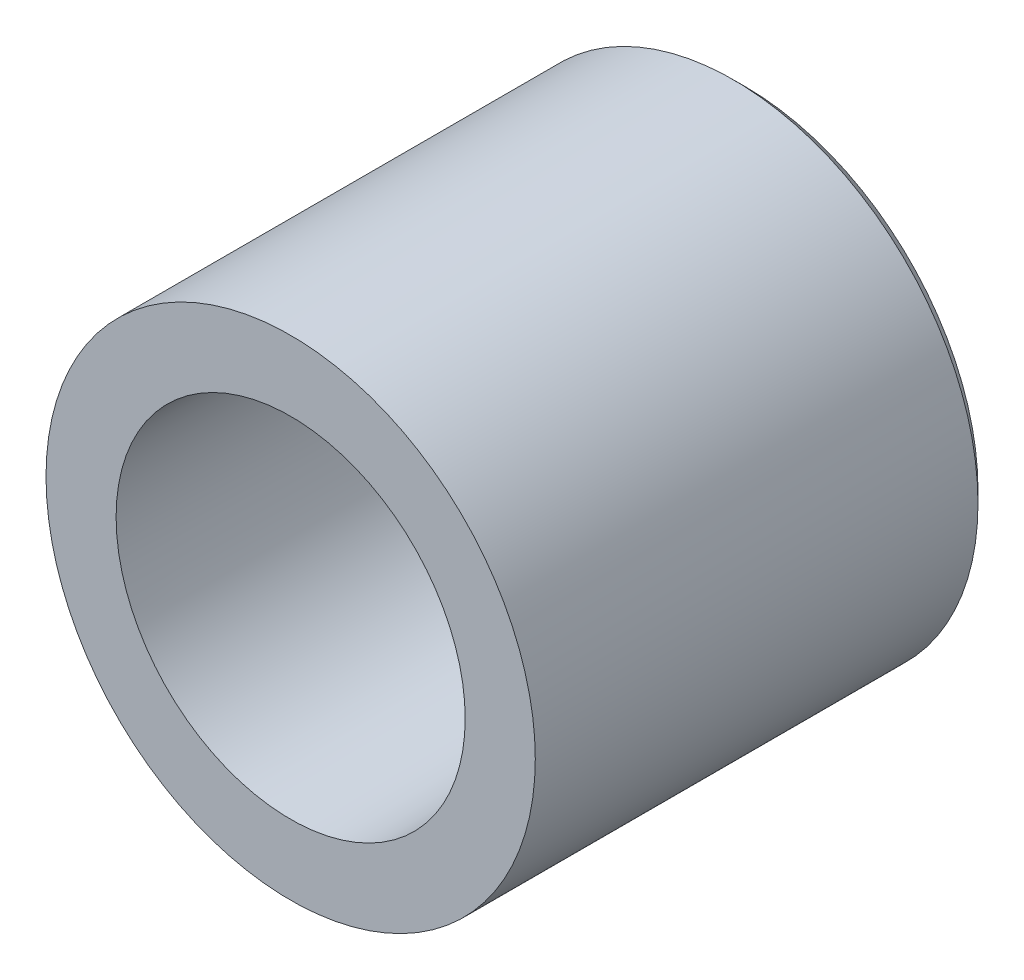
ISO-10303-21;
HEADER;
FILE_DESCRIPTION(('STEP AP214'),'2;1');
FILE_NAME('part.step','',(''),(''),'','','');
FILE_SCHEMA(('AUTOMOTIVE_DESIGN { 1 0 10303 214 1 1 1 1 }'));
ENDSEC;
DATA;
#1=APPLICATION_CONTEXT('core data for automotive mechanical design processes');
#2=APPLICATION_PROTOCOL_DEFINITION('international standard','automotive_design',2000,#1);
#3=PRODUCT_CONTEXT('',#1,'mechanical');
#4=PRODUCT('Part','Part','',(#3));
#5=PRODUCT_RELATED_PRODUCT_CATEGORY('part','',(#4));
#6=PRODUCT_DEFINITION_FORMATION('','',#4);
#7=PRODUCT_DEFINITION_CONTEXT('part definition',#1,'design');
#8=PRODUCT_DEFINITION('design','',#6,#7);
#9=PRODUCT_DEFINITION_SHAPE('','',#8);
#10=(LENGTH_UNIT() NAMED_UNIT(*) SI_UNIT(.MILLI.,.METRE.));
#11=(NAMED_UNIT(*) PLANE_ANGLE_UNIT() SI_UNIT($,.RADIAN.));
#12=(NAMED_UNIT(*) SI_UNIT($,.STERADIAN.) SOLID_ANGLE_UNIT());
#13=UNCERTAINTY_MEASURE_WITH_UNIT(LENGTH_MEASURE(1.E-05),#10,'distance_accuracy_value','');
#14=(GEOMETRIC_REPRESENTATION_CONTEXT(3) GLOBAL_UNCERTAINTY_ASSIGNED_CONTEXT((#13)) GLOBAL_UNIT_ASSIGNED_CONTEXT((#10,
#11,#12)) REPRESENTATION_CONTEXT('',''));
#15=CARTESIAN_POINT('',(0.,0.,0.));
#16=DIRECTION('',(0.,0.,1.));
#17=DIRECTION('',(1.,0.,0.));
#18=AXIS2_PLACEMENT_3D('',#15,#16,#17);
#19=CARTESIAN_POINT('',(-1.39382166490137E-13,0.,-19.9603195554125));
#20=DIRECTION('',(0.,0.,1.));
#21=DIRECTION('',(1.,0.,0.));
#22=AXIS2_PLACEMENT_3D('',#19,#20,#21);
#23=CONICAL_SURFACE('',#22,20.6207588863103,0.785398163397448);
#24=CARTESIAN_POINT('',(-1.88539992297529E-13,0.,-27.));
#25=DIRECTION('',(0.,0.,1.));
#26=DIRECTION('',(-1.,0.,0.));
#27=AXIS2_PLACEMENT_3D('',#24,#25,#26);
#28=CIRCLE('',#27,13.5810784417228);
#29=CARTESIAN_POINT('',(13.5810784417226,0.,-27.));
#30=VERTEX_POINT('',#29);
#31=CARTESIAN_POINT('',(-13.581078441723,0.,-27.));
#32=VERTEX_POINT('',#31);
#33=EDGE_CURVE('E143',#30,#32,#28,.T.);
#34=ORIENTED_EDGE('',*,*,#33,.F.);
#35=CARTESIAN_POINT('',(13.5810785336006,0.,-26.9999999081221));
#36=CARTESIAN_POINT('',(14.5810800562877,0.,-25.999998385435));
#37=B_SPLINE_CURVE_WITH_KNOTS('',1,(#35,#36),.UNSPECIFIED.,.F.,.F.,(2,2),(0.658611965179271,
0.707106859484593),.UNSPECIFIED.);
#38=CARTESIAN_POINT('',(14.5810784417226,0.,-26.));
#39=VERTEX_POINT('',#38);
#40=EDGE_CURVE('E44',#30,#39,#37,.T.);
#41=ORIENTED_EDGE('',*,*,#40,.T.);
#42=CARTESIAN_POINT('',(-1.81557029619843E-13,0.,-26.));
#43=DIRECTION('',(0.,0.,-1.));
#44=DIRECTION('',(-1.,0.,0.));
#45=AXIS2_PLACEMENT_3D('',#42,#43,#44);
#46=CIRCLE('',#45,14.5810784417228);
#47=CARTESIAN_POINT('',(-14.581078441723,0.,-26.));
#48=VERTEX_POINT('',#47);
#49=EDGE_CURVE('E11',#48,#39,#46,.T.);
#50=ORIENTED_EDGE('',*,*,#49,.F.);
#51=CARTESIAN_POINT('',(-1.81557029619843E-13,0.,-26.));
#52=DIRECTION('',(0.,0.,-1.));
#53=DIRECTION('',(-1.,0.,0.));
#54=AXIS2_PLACEMENT_3D('',#51,#52,#53);
#55=CIRCLE('',#54,14.5810784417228);
#56=EDGE_CURVE('E51',#39,#48,#55,.T.);
#57=ORIENTED_EDGE('',*,*,#56,.F.);
#58=ORIENTED_EDGE('',*,*,#40,.F.);
#59=CARTESIAN_POINT('',(-1.88539992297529E-13,0.,-27.));
#60=DIRECTION('',(0.,0.,1.));
#61=DIRECTION('',(-1.,0.,0.));
#62=AXIS2_PLACEMENT_3D('',#59,#60,#61);
#63=CIRCLE('',#62,13.5810784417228);
#64=EDGE_CURVE('E59',#32,#30,#63,.T.);
#65=ORIENTED_EDGE('',*,*,#64,.F.);
#66=EDGE_LOOP('',(#34,#41,#50,#57,#58,#65));
#67=FACE_BOUND('',#66,.T.);
#68=ADVANCED_FACE('F36',(#67),#23,.F.);
#69=CARTESIAN_POINT('',(-1.78065548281E-13,0.,-25.5));
#70=DIRECTION('',(0.,0.,-1.));
#71=DIRECTION('',(-1.,0.,0.));
#72=AXIS2_PLACEMENT_3D('',#69,#70,#71);
#73=CYLINDRICAL_SURFACE('',#72,14.5810784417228);
#74=CARTESIAN_POINT('',(-1.6759110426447E-13,0.,-24.));
#75=DIRECTION('',(0.,0.,-1.));
#76=DIRECTION('',(-1.,0.,0.));
#77=AXIS2_PLACEMENT_3D('',#74,#75,#76);
#78=CIRCLE('',#77,14.5810784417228);
#79=CARTESIAN_POINT('',(-14.5810784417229,0.,-24.));
#80=VERTEX_POINT('',#79);
#81=EDGE_CURVE('E152',#80,#80,#78,.T.);
#82=ORIENTED_EDGE('',*,*,#81,.F.);
#83=CARTESIAN_POINT('',(-14.5810784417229,0.,-23.9999969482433));
#84=CARTESIAN_POINT('',(-14.581078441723,0.,-26.0000020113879));
#85=B_SPLINE_CURVE_WITH_KNOTS('',1,(#83,#84),.UNSPECIFIED.,.F.,.F.,(2,2),(0.0833320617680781,
0.91666750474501),.UNSPECIFIED.);
#86=EDGE_CURVE('E147',#80,#48,#85,.T.);
#87=ORIENTED_EDGE('',*,*,#86,.T.);
#88=ORIENTED_EDGE('',*,*,#49,.T.);
#89=ORIENTED_EDGE('',*,*,#56,.T.);
#90=ORIENTED_EDGE('',*,*,#86,.F.);
#91=EDGE_LOOP('',(#82,#87,#88,#89,#90));
#92=FACE_BOUND('',#91,.T.);
#93=ADVANCED_FACE('F191',(#92),#73,.F.);
#94=CARTESIAN_POINT('',(31.2364804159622,-28.2277414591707,-27.));
#95=DIRECTION('',(0.,0.,-1.));
#96=DIRECTION('',(-1.,0.,0.));
#97=AXIS2_PLACEMENT_3D('',#94,#95,#96);
#98=PLANE('',#97);
#99=CARTESIAN_POINT('',(-2.79318507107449E-13,0.,-26.9999999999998));
#100=DIRECTION('',(0.,0.,-1.));
#101=DIRECTION('',(-1.,0.,0.));
#102=AXIS2_PLACEMENT_3D('',#99,#100,#101);
#103=CIRCLE('',#102,5.09999999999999);
#104=CARTESIAN_POINT('',(-5.10000000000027,0.,-26.9999999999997));
#105=VERTEX_POINT('',#104);
#106=EDGE_CURVE('E103',#105,#105,#103,.T.);
#107=ORIENTED_EDGE('',*,*,#106,.T.);
#108=EDGE_LOOP('',(#107));
#109=FACE_BOUND('',#108,.T.);
#110=ORIENTED_EDGE('',*,*,#64,.T.);
#111=ORIENTED_EDGE('',*,*,#33,.T.);
#112=EDGE_LOOP('',(#110,#111));
#113=FACE_BOUND('',#112,.T.);
#114=ADVANCED_FACE('F193',(#109,#113),#98,.F.);
#115=CARTESIAN_POINT('',(0.,0.,-1.));
#116=DIRECTION('',(0.,0.,1.));
#117=DIRECTION('',(-1.,0.,0.));
#118=AXIS2_PLACEMENT_3D('',#115,#116,#117);
#119=CONICAL_SURFACE('',#118,14.9825449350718,0.0174532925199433);
#120=ORIENTED_EDGE('',*,*,#81,.T.);
#121=CARTESIAN_POINT('',(-14.5810784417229,0.,-24.));
#122=CARTESIAN_POINT('',(-14.9825449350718,0.,-0.999999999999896));
#123=B_SPLINE_CURVE_WITH_KNOTS('',1,(#121,#122),.UNSPECIFIED.,.F.,.F.,(2,2),(0.,1.),.UNSPECIFIED.);
#124=CARTESIAN_POINT('',(-14.9825449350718,0.,-0.999999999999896));
#125=VERTEX_POINT('',#124);
#126=EDGE_CURVE('E108',#80,#125,#123,.T.);
#127=ORIENTED_EDGE('',*,*,#126,.T.);
#128=CARTESIAN_POINT('',(0.,0.,-1.));
#129=DIRECTION('',(0.,0.,-1.));
#130=DIRECTION('',(1.,0.,0.));
#131=AXIS2_PLACEMENT_3D('',#128,#129,#130);
#132=CIRCLE('',#131,14.9825449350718);
#133=CARTESIAN_POINT('',(14.9825449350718,0.,-1.0000000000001));
#134=VERTEX_POINT('',#133);
#135=EDGE_CURVE('E133',#134,#125,#132,.T.);
#136=ORIENTED_EDGE('',*,*,#135,.F.);
#137=CARTESIAN_POINT('',(0.,0.,-1.));
#138=DIRECTION('',(0.,0.,-1.));
#139=DIRECTION('',(1.,0.,0.));
#140=AXIS2_PLACEMENT_3D('',#137,#138,#139);
#141=CIRCLE('',#140,14.9825449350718);
#142=EDGE_CURVE('E126',#125,#134,#141,.T.);
#143=ORIENTED_EDGE('',*,*,#142,.F.);
#144=ORIENTED_EDGE('',*,*,#126,.F.);
#145=EDGE_LOOP('',(#120,#127,#136,#143,#144));
#146=FACE_BOUND('',#145,.T.);
#147=ADVANCED_FACE('F189',(#146),#119,.F.);
#148=CARTESIAN_POINT('',(-2.11594349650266E-13,0.,-30.301515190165));
#149=DIRECTION('',(0.,0.,1.));
#150=DIRECTION('',(1.,0.,0.));
#151=AXIS2_PLACEMENT_3D('',#148,#149,#150);
#152=CONICAL_SURFACE('',#151,29.698484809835,0.785398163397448);
#153=CARTESIAN_POINT('',(-2.7931850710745E-13,0.,-40.));
#154=DIRECTION('',(0.,0.,1.));
#155=DIRECTION('',(-1.,0.,0.));
#156=AXIS2_PLACEMENT_3D('',#153,#154,#155);
#157=CIRCLE('',#156,20.);
#158=CARTESIAN_POINT('',(-20.0000000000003,0.,-40.));
#159=VERTEX_POINT('',#158);
#160=CARTESIAN_POINT('',(19.9999999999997,0.,-40.));
#161=VERTEX_POINT('',#160);
#162=EDGE_CURVE('E90',#159,#161,#157,.T.);
#163=ORIENTED_EDGE('',*,*,#162,.T.);
#164=CARTESIAN_POINT('',(20.0000025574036,0.,-39.9999974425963));
#165=CARTESIAN_POINT('',(21.0000013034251,0.,-38.9999986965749));
#166=B_SPLINE_CURVE_WITH_KNOTS('',1,(#164,#165),.UNSPECIFIED.,.F.,.F.,(2,2),(0.673435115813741,
0.707106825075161),.UNSPECIFIED.);
#167=CARTESIAN_POINT('',(20.9999999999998,0.,-39.));
#168=VERTEX_POINT('',#167);
#169=EDGE_CURVE('E95',#161,#168,#166,.T.);
#170=ORIENTED_EDGE('',*,*,#169,.T.);
#171=CARTESIAN_POINT('',(-2.72335544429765E-13,0.,-39.));
#172=DIRECTION('',(0.,0.,-1.));
#173=DIRECTION('',(-1.,0.,0.));
#174=AXIS2_PLACEMENT_3D('',#171,#172,#173);
#175=CIRCLE('',#174,21.);
#176=CARTESIAN_POINT('',(-21.0000000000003,0.,-39.));
#177=VERTEX_POINT('',#176);
#178=EDGE_CURVE('E102',#168,#177,#175,.T.);
#179=ORIENTED_EDGE('',*,*,#178,.T.);
#180=CARTESIAN_POINT('',(-2.72335544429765E-13,0.,-39.));
#181=DIRECTION('',(0.,0.,-1.));
#182=DIRECTION('',(-1.,0.,0.));
#183=AXIS2_PLACEMENT_3D('',#180,#181,#182);
#184=CIRCLE('',#183,21.);
#185=EDGE_CURVE('E105',#177,#168,#184,.T.);
#186=ORIENTED_EDGE('',*,*,#185,.T.);
#187=ORIENTED_EDGE('',*,*,#169,.F.);
#188=CARTESIAN_POINT('',(-2.7931850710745E-13,0.,-40.));
#189=DIRECTION('',(0.,0.,1.));
#190=DIRECTION('',(-1.,0.,0.));
#191=AXIS2_PLACEMENT_3D('',#188,#189,#190);
#192=CIRCLE('',#191,20.);
#193=EDGE_CURVE('E97',#161,#159,#192,.T.);
#194=ORIENTED_EDGE('',*,*,#193,.T.);
#195=EDGE_LOOP('',(#163,#170,#179,#186,#187,#194));
#196=FACE_BOUND('',#195,.T.);
#197=ADVANCED_FACE('F92',(#196),#152,.T.);
#198=CARTESIAN_POINT('',(-1.43150734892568E-13,0.,-20.5));
#199=DIRECTION('',(0.,0.,-1.));
#200=DIRECTION('',(-1.,0.,0.));
#201=AXIS2_PLACEMENT_3D('',#198,#199,#200);
#202=CYLINDRICAL_SURFACE('',#201,21.);
#203=CARTESIAN_POINT('',(0.,0.,-1.));
#204=DIRECTION('',(0.,0.,1.));
#205=DIRECTION('',(-1.,0.,0.));
#206=AXIS2_PLACEMENT_3D('',#203,#204,#205);
#207=CIRCLE('',#206,21.);
#208=CARTESIAN_POINT('',(-21.,0.,-0.999999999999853));
#209=VERTEX_POINT('',#208);
#210=EDGE_CURVE('E99',#209,#209,#207,.T.);
#211=ORIENTED_EDGE('',*,*,#210,.F.);
#212=CARTESIAN_POINT('',(-21.,0.,-0.999998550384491));
#213=CARTESIAN_POINT('',(-21.0000000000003,0.,-38.9999995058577));
#214=B_SPLINE_CURVE_WITH_KNOTS('',1,(#212,#213),.UNSPECIFIED.,.F.,.F.,(2,2),(0.0833333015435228,
0.916666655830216),.UNSPECIFIED.);
#215=EDGE_CURVE('E173',#209,#177,#214,.T.);
#216=ORIENTED_EDGE('',*,*,#215,.T.);
#217=ORIENTED_EDGE('',*,*,#178,.F.);
#218=ORIENTED_EDGE('',*,*,#185,.F.);
#219=ORIENTED_EDGE('',*,*,#215,.F.);
#220=EDGE_LOOP('',(#211,#216,#217,#218,#219));
#221=FACE_BOUND('',#220,.T.);
#222=ADVANCED_FACE('F225',(#221),#202,.T.);
#223=CARTESIAN_POINT('',(46.,-41.5692193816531,-40.));
#224=DIRECTION('',(0.,0.,-1.));
#225=DIRECTION('',(-1.,0.,0.));
#226=AXIS2_PLACEMENT_3D('',#223,#224,#225);
#227=PLANE('',#226);
#228=CARTESIAN_POINT('',(-2.79318507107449E-13,0.,-39.9999999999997));
#229=DIRECTION('',(0.,0.,-1.));
#230=DIRECTION('',(-1.,0.,0.));
#231=AXIS2_PLACEMENT_3D('',#228,#229,#230);
#232=CIRCLE('',#231,5.09999999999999);
#233=CARTESIAN_POINT('',(-5.10000000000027,0.,-39.9999999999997));
#234=VERTEX_POINT('',#233);
#235=EDGE_CURVE('E275',#234,#234,#232,.T.);
#236=ORIENTED_EDGE('',*,*,#235,.F.);
#237=EDGE_LOOP('',(#236));
#238=FACE_BOUND('',#237,.T.);
#239=ORIENTED_EDGE('',*,*,#193,.F.);
#240=ORIENTED_EDGE('',*,*,#162,.F.);
#241=EDGE_LOOP('',(#239,#240));
#242=FACE_BOUND('',#241,.T.);
#243=ADVANCED_FACE('F101',(#238,#242),#227,.T.);
#244=CARTESIAN_POINT('',(-27.3,-43.6476803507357,-0.999999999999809));
#245=DIRECTION('',(0.,0.,1.));
#246=DIRECTION('',(1.,0.,0.));
#247=AXIS2_PLACEMENT_3D('',#244,#245,#246);
#248=PLANE('',#247);
#249=ORIENTED_EDGE('',*,*,#210,.T.);
#250=EDGE_LOOP('',(#249));
#251=FACE_BOUND('',#250,.T.);
#252=ORIENTED_EDGE('',*,*,#135,.T.);
#253=ORIENTED_EDGE('',*,*,#142,.T.);
#254=EDGE_LOOP('',(#252,#253));
#255=FACE_BOUND('',#254,.T.);
#256=ADVANCED_FACE('F240',(#251,#255),#248,.T.);
#257=CARTESIAN_POINT('',(-2.79318507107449E-13,0.,-39.9999999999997));
#258=DIRECTION('',(0.,0.,-1.));
#259=DIRECTION('',(-1.,0.,0.));
#260=AXIS2_PLACEMENT_3D('',#257,#258,#259);
#261=CYLINDRICAL_SURFACE('',#260,5.09999999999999);
#262=ORIENTED_EDGE('',*,*,#235,.T.);
#263=EDGE_LOOP('',(#262));
#264=FACE_BOUND('',#263,.T.);
#265=ORIENTED_EDGE('',*,*,#106,.F.);
#266=EDGE_LOOP('',(#265));
#267=FACE_BOUND('',#266,.T.);
#268=ADVANCED_FACE('F248',(#264,#267),#261,.F.);
#269=CLOSED_SHELL('',(#68,#93,#114,#147,#197,#222,#243,#256,#268));
#270=MANIFOLD_SOLID_BREP('B2',#269);
#271=ADVANCED_BREP_SHAPE_REPRESENTATION('',(#18,#270),#14);
#272=SHAPE_DEFINITION_REPRESENTATION(#9,#271);
ENDSEC;
END-ISO-10303-21;
